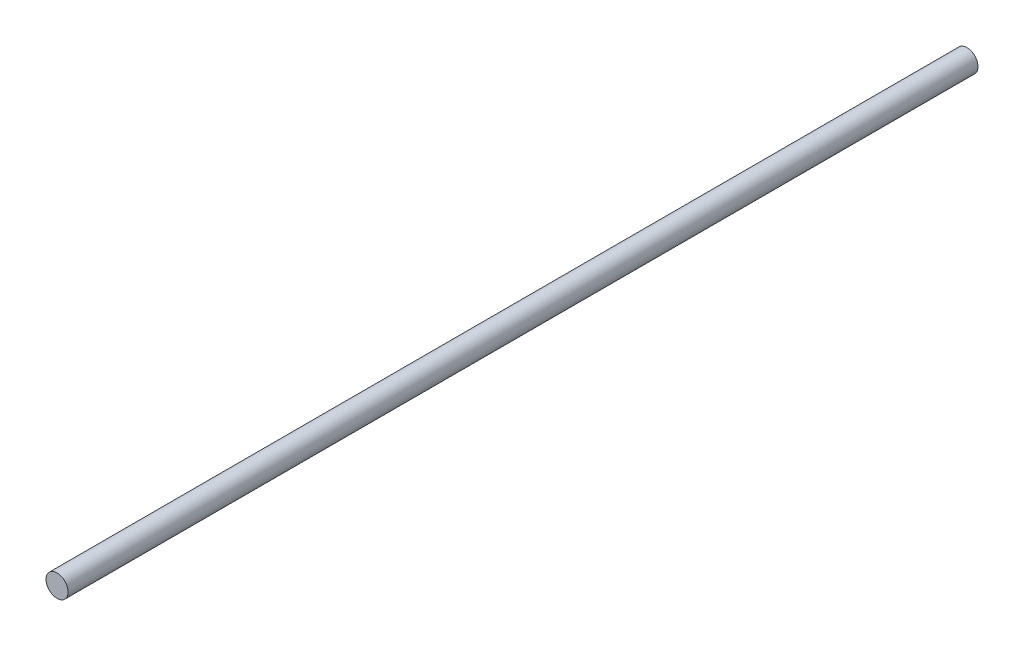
from build123d import *

# Parameters (mm, degrees)
SKETCH1_R           = 15
BOSS_EXTRUDE1_DEPTH = 1236


with BuildPart() as part:
    # Sketch1 → Boss-Extrude1 (new body)
    with BuildSketch(Plane.XY):
        Circle(SKETCH1_R)
    extrude(amount=BOSS_EXTRUDE1_DEPTH)


solid = part.part
